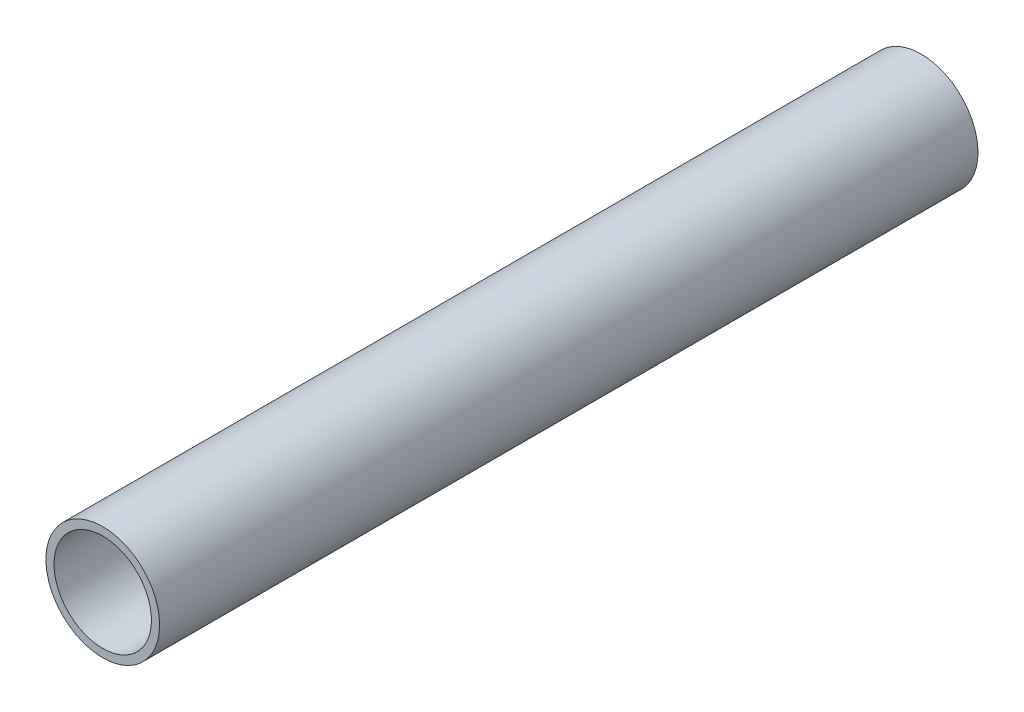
ISO-10303-21;
HEADER;
FILE_DESCRIPTION(('STEP AP214'),'2;1');
FILE_NAME('part.step','',(''),(''),'','','');
FILE_SCHEMA(('AUTOMOTIVE_DESIGN { 1 0 10303 214 1 1 1 1 }'));
ENDSEC;
DATA;
#1=APPLICATION_CONTEXT('core data for automotive mechanical design processes');
#2=APPLICATION_PROTOCOL_DEFINITION('international standard','automotive_design',2000,#1);
#3=PRODUCT_CONTEXT('',#1,'mechanical');
#4=PRODUCT('Part','Part','',(#3));
#5=PRODUCT_RELATED_PRODUCT_CATEGORY('part','',(#4));
#6=PRODUCT_DEFINITION_FORMATION('','',#4);
#7=PRODUCT_DEFINITION_CONTEXT('part definition',#1,'design');
#8=PRODUCT_DEFINITION('design','',#6,#7);
#9=PRODUCT_DEFINITION_SHAPE('','',#8);
#10=(LENGTH_UNIT() NAMED_UNIT(*) SI_UNIT(.MILLI.,.METRE.));
#11=(NAMED_UNIT(*) PLANE_ANGLE_UNIT() SI_UNIT($,.RADIAN.));
#12=(NAMED_UNIT(*) SI_UNIT($,.STERADIAN.) SOLID_ANGLE_UNIT());
#13=UNCERTAINTY_MEASURE_WITH_UNIT(LENGTH_MEASURE(1.E-05),#10,'distance_accuracy_value','');
#14=(GEOMETRIC_REPRESENTATION_CONTEXT(3) GLOBAL_UNCERTAINTY_ASSIGNED_CONTEXT((#13)) GLOBAL_UNIT_ASSIGNED_CONTEXT((#10,
#11,#12)) REPRESENTATION_CONTEXT('',''));
#15=CARTESIAN_POINT('',(0.,0.,0.));
#16=DIRECTION('',(0.,0.,1.));
#17=DIRECTION('',(1.,0.,0.));
#18=AXIS2_PLACEMENT_3D('',#15,#16,#17);
#19=CARTESIAN_POINT('',(0.,0.,252.));
#20=DIRECTION('',(0.,0.,1.));
#21=DIRECTION('',(1.,0.,0.));
#22=AXIS2_PLACEMENT_3D('',#19,#20,#21);
#23=PLANE('',#22);
#24=CARTESIAN_POINT('',(0.,0.,252.));
#25=DIRECTION('',(0.,0.,1.));
#26=DIRECTION('',(1.,0.,0.));
#27=AXIS2_PLACEMENT_3D('',#24,#25,#26);
#28=CIRCLE('',#27,17.5);
#29=CARTESIAN_POINT('',(17.5,0.,252.));
#30=VERTEX_POINT('',#29);
#31=EDGE_CURVE('E11',#30,#30,#28,.T.);
#32=ORIENTED_EDGE('',*,*,#31,.T.);
#33=EDGE_LOOP('',(#32));
#34=FACE_BOUND('',#33,.T.);
#35=CARTESIAN_POINT('',(0.,0.,252.));
#36=DIRECTION('',(0.,0.,1.));
#37=DIRECTION('',(1.,0.,0.));
#38=AXIS2_PLACEMENT_3D('',#35,#36,#37);
#39=CIRCLE('',#38,15.);
#40=CARTESIAN_POINT('',(15.,0.,252.));
#41=VERTEX_POINT('',#40);
#42=EDGE_CURVE('E46',#41,#41,#39,.T.);
#43=ORIENTED_EDGE('',*,*,#42,.F.);
#44=EDGE_LOOP('',(#43));
#45=FACE_BOUND('',#44,.T.);
#46=ADVANCED_FACE('F35',(#34,#45),#23,.T.);
#47=CARTESIAN_POINT('',(0.,0.,0.));
#48=DIRECTION('',(0.,0.,1.));
#49=DIRECTION('',(1.,0.,0.));
#50=AXIS2_PLACEMENT_3D('',#47,#48,#49);
#51=PLANE('',#50);
#52=CARTESIAN_POINT('',(0.,0.,0.));
#53=DIRECTION('',(0.,0.,1.));
#54=DIRECTION('',(1.,0.,0.));
#55=AXIS2_PLACEMENT_3D('',#52,#53,#54);
#56=CIRCLE('',#55,17.5);
#57=CARTESIAN_POINT('',(17.5,0.,0.));
#58=VERTEX_POINT('',#57);
#59=EDGE_CURVE('E39',#58,#58,#56,.T.);
#60=ORIENTED_EDGE('',*,*,#59,.F.);
#61=EDGE_LOOP('',(#60));
#62=FACE_BOUND('',#61,.T.);
#63=CARTESIAN_POINT('',(0.,0.,0.));
#64=DIRECTION('',(0.,0.,1.));
#65=DIRECTION('',(1.,0.,0.));
#66=AXIS2_PLACEMENT_3D('',#63,#64,#65);
#67=CIRCLE('',#66,15.);
#68=CARTESIAN_POINT('',(15.,0.,0.));
#69=VERTEX_POINT('',#68);
#70=EDGE_CURVE('E48',#69,#69,#67,.T.);
#71=ORIENTED_EDGE('',*,*,#70,.T.);
#72=EDGE_LOOP('',(#71));
#73=FACE_BOUND('',#72,.T.);
#74=ADVANCED_FACE('F58',(#62,#73),#51,.F.);
#75=CARTESIAN_POINT('',(0.,0.,252.));
#76=DIRECTION('',(0.,0.,-1.));
#77=DIRECTION('',(-1.,0.,0.));
#78=AXIS2_PLACEMENT_3D('',#75,#76,#77);
#79=CYLINDRICAL_SURFACE('',#78,17.5);
#80=ORIENTED_EDGE('',*,*,#31,.F.);
#81=EDGE_LOOP('',(#80));
#82=FACE_BOUND('',#81,.T.);
#83=ORIENTED_EDGE('',*,*,#59,.T.);
#84=EDGE_LOOP('',(#83));
#85=FACE_BOUND('',#84,.T.);
#86=ADVANCED_FACE('F37',(#82,#85),#79,.T.);
#87=CARTESIAN_POINT('',(0.,0.,252.));
#88=DIRECTION('',(0.,0.,-1.));
#89=DIRECTION('',(-1.,0.,0.));
#90=AXIS2_PLACEMENT_3D('',#87,#88,#89);
#91=CYLINDRICAL_SURFACE('',#90,15.);
#92=ORIENTED_EDGE('',*,*,#42,.T.);
#93=EDGE_LOOP('',(#92));
#94=FACE_BOUND('',#93,.T.);
#95=ORIENTED_EDGE('',*,*,#70,.F.);
#96=EDGE_LOOP('',(#95));
#97=FACE_BOUND('',#96,.T.);
#98=ADVANCED_FACE('F54',(#94,#97),#91,.F.);
#99=CLOSED_SHELL('',(#46,#74,#86,#98));
#100=MANIFOLD_SOLID_BREP('B2',#99);
#101=ADVANCED_BREP_SHAPE_REPRESENTATION('',(#18,#100),#14);
#102=SHAPE_DEFINITION_REPRESENTATION(#9,#101);
ENDSEC;
END-ISO-10303-21;
